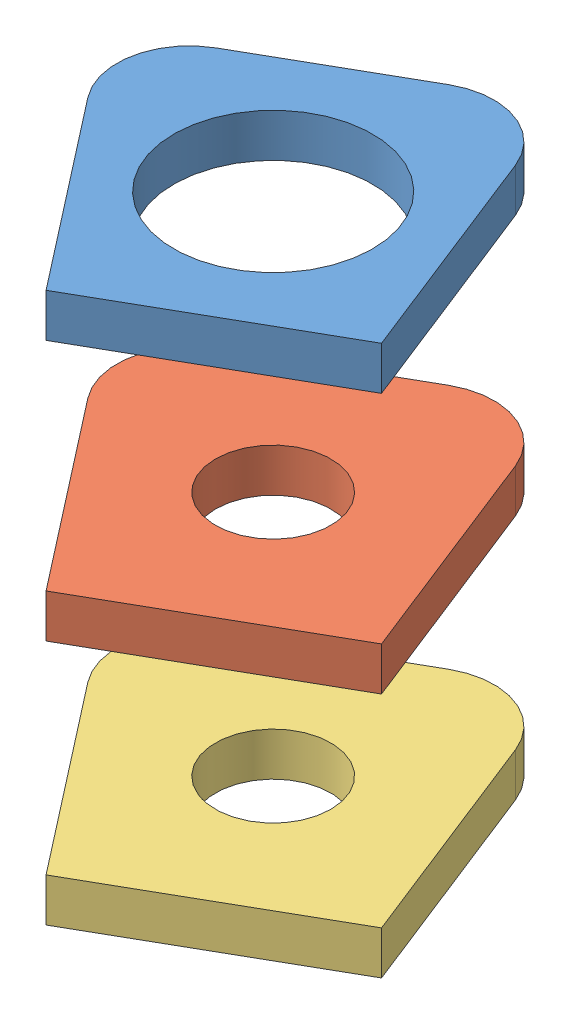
SolidWorks assembly Spindle_Assy.SLDASM, configuration Default (file format 6000). Lengths in mm.
Overall size (66.79 81 66.79).
20 component instances, 13 part files, 31 mates.
Components (placement in the parent):
- spindle_housing-1: spindle_housing.SLDPRT [Default] at origin (suppressed, hidden)
- spindle-top_plate-1: spindle-top_plate.SLDPRT [Default] at (-47.6912 75 -6.5455) x (0.964551 0 0.263896) z (-0.263896 0 0.964551) size (54.37 6 54.37)
- spindle-mid_plate-1: spindle-mid_plate.SLDPRT [Default] at (-47.6912 3 -6.5455) x (0.964551 0 0.263896) z (-0.263896 0 0.964551) size (54.37 6 54.37)
- spindle-bottom_plate-1: spindle-bottom_plate.SLDPRT [Default] at (-47.6912 -65 -6.5455) x (0.964551 0 0.263896) z (-0.263896 0 0.964551) size (54.37 6 54.37)
- spindle motor-1: spindle motor.SLDPRT [Default] at (0 101.5 0) x (0.33068 0 0.943743) z (0.943743 0 -0.33068) (suppressed, hidden)
- motor coupler-1: motor coupler.SLDPRT [large bore] at (0 60.1469 0) x (-0.335317 0 -0.942105) z (-0.942105 0 0.335317) (suppressed, hidden)
- motor coupler-2: motor coupler.SLDPRT [large bore] at (0 39.7675 0) x (0.335317 0 0.942105) z (-0.942105 0 0.335317) (suppressed, hidden)
- spindle sleeve-1: spindle sleeve.SLDPRT [Default] at (0 53.4 0) x (0.702313 0 0.711868) z (-0.711868 0 0.702313) (suppressed, hidden)
- spider-1: spider.SLDPRT [Default] at (0 48.3281 0) x (0.761446 0 0.648229) z (-0.648229 0 0.761446) (suppressed, hidden)
- spindle_bearing-1: spindle_bearing.SLDPRT [57155K337] at (0 1.2383 0) x (1 0 0) z (0 1 0) (suppressed, hidden)
- spindle_bearing-2: spindle_bearing.SLDPRT [57155K337] at (0 36.8618 0) x (1 0 0) z (0 -1 0) (suppressed, hidden)
- spindle_toolholder-1: spindle_toolholder.SLDPRT [Default] at (0 -1.5405 0) x (-0.751303 0 -0.659957) z (-0.659957 0 0.751303) (suppressed, hidden)
- spindle_shim-1: spindle_shim.SLDPRT [Default] at (0 39.6405 0) (suppressed, hidden)
- spindle_shaft-1: spindle_shaft.SLDPRT [Default] at (0 45.4495 0) x (-1 0 0) z (0 0 1) (suppressed, hidden)
- M3x12 BHCS-1: M3x12 BHCS.SLDPRT [92095A183] at (17.8141 72 8.2591) x (-0.823919 0.316742 0.469928) z (-0.495438 0 -0.868643) (suppressed, hidden)
- M3x12 BHCS-2: M3x12 BHCS.SLDPRT [92095A183] at (-1.9601 72 19.5375) x (-0.868643 0 0.495438) z (-0.495438 0 -0.868643) (suppressed, hidden)
- M3x12 BHCS-3: M3x12 BHCS.SLDPRT [92095A183] at (-1.9601 2 19.5375) x (-0.868643 0 0.495438) z (-0.495438 0 -0.868643) (suppressed, hidden)
- M3x12 BHCS-4: M3x12 BHCS.SLDPRT [92095A183] at (17.8141 2 8.2591) x (-0.868643 0 0.495438) z (-0.495438 0 -0.868643) (suppressed, hidden)
- M3x12 BHCS-5: M3x12 BHCS.SLDPRT [92095A183] at (17.8141 36 8.2591) x (-0.868643 0 0.495438) z (-0.495438 0 -0.868643) (suppressed, hidden)
- M3x12 BHCS-6: M3x12 BHCS.SLDPRT [92095A183] at (-1.9601 36 19.5375) x (-0.868643 0 0.495438) z (-0.495438 0 -0.868643) (suppressed, hidden)
Mates (geometry in assembly coordinates):
- Concentric1: concentric anti-aligned: cylinder of spindle_housing-1 through (0 38.1 0) axis (0 -1 0) radius 6.35; cylinder of spindle_bearing-1 through (0 3.6195 0) axis (0 1 0) radius 6.35
- Concentric2: concentric aligned: cylinder of spindle_bearing-2 through (0 34.4805 0) axis (0 -1 0) radius 6.35; cylinder of spindle_housing-1 through (0 38.1 0) axis (0 -1 0) radius 6.35
- Coincident1: coincident anti-aligned: plane of spindle_housing-1 through (0 38.1 0) normal (0 1 0); plane of spindle_bearing-2 through (0 38.1 5.1114) normal (0 -1 0)
- Coincident2: coincident anti-aligned: plane of spindle_housing-1 through (0 0 0) normal (0 -1 0); plane of spindle_bearing-1 through (0 0 -5.1114) normal (0 1 0)
- Concentric3: concentric aligned: cylinder of spindle motor-1 through (0 69 0) axis (0 1 0) radius 13.75; cylinder of spindle-top_plate-1 through (0 69 0) axis (0 1 0) radius 13.75
- Concentric4: concentric anti-aligned: cylinder of spindle_housing-1 through (0 38.1 0) axis (0 -1 0) radius 7.9375; cylinder of spindle-mid_plate-1 through (0 33 0) axis (0 1 0) radius 7.97
- Concentric5: concentric aligned: cylinder of spindle_housing-1 through (0 38.1 0) axis (0 -1 0) radius 7.9375; cylinder of spindle-bottom_plate-1 through (0 5 0) axis (0 -1 0) radius 7.97
- Concentric6: concentric anti-aligned: cylinder of spindle_housing-1 through (0 38.1 0) axis (0 -1 0) radius 7.9375; cylinder of spindle motor-1 through (0 69 0) axis (0 1 0) radius 13.75
- Distance4: distance = 1 mm aligned: plane of spindle_housing-1 through (0 0 0) normal (0 -1 0); plane of spindle-bottom_plate-1 through (4.2952 -1 -16.2381) normal (0 -1 0)
- Concentric7: concentric aligned: cylinder of spindle motor-1 through (0 104.4 0) axis (0 -1 0) radius 1.15; cylinder of spindle sleeve-1 through (0 65.4 0) axis (0 -1 0) radius 1.1303
- Coincident12: coincident aligned: plane of spindle motor-1 through (0 53.4 0) normal (0 -1 0); plane of spindle sleeve-1 through (0 53.4 0) normal (0 -1 0)
- Concentric8: concentric anti-aligned: cylinder of motor coupler-1 through (0 49.8281 0) axis (0 1 0) radius 3.175; cylinder of spindle sleeve-1 through (0 65.4 0) axis (0 -1 0) radius 3.175
- Coincident13: coincident aligned: plane of spindle-top_plate-1 through (-47.6912 69 -6.5455) normal (0 -1 0); plane of spindle motor-1 through (0 69 0) normal (0 -1 0)
- Concentric9: concentric aligned: cylinder of spindle_toolholder-1 through (0 -1.5405 0) axis (0 1 0) radius 3.175; cylinder of spindle_shaft-1 through (0 -8.5255 0) axis (0 1 0) radius 3.175
- Coincident14: coincident anti-aligned: plane of spindle_toolholder-1 through (2.3854 -8.5255 2.0954) normal (0 1 0); plane of spindle_shaft-1 through (0 -8.5255 0) normal (0 -1 0)
- Concentric10: concentric aligned: cylinder of spindle_shaft-1 through (0 -8.5255 0) axis (0 1 0) radius 3.175; cylinder of spindle_bearing-1 through (0 3.6195 0) axis (0 1 0) radius 3.175
- Coincident15: coincident anti-aligned: plane of spindle_bearing-1 through (0 -1.5405 -4.1755) normal (0 -1 0); plane of spindle_toolholder-1 through (4.7708 -1.5405 4.1907) normal (0 1 0)
- Concentric11: concentric aligned: circle of spindle_shim-1; cylinder of spindle_shaft-1 through (0 -8.5255 0) axis (0 1 0) radius 3.175
- Coincident16: coincident anti-aligned: plane of spindle_bearing-2 through (0 39.6405 4.1755) normal (0 1 0); plane of spindle_shim-1 through (0 39.6405 0) normal (0 -1 0)
- Coincident17: coincident aligned: plane of motor coupler-1 through (0 53.4 0) normal (0 -1 0); plane of spindle sleeve-1 through (0 53.4 0) normal (0 -1 0)
- Distance5: distance = 1.5 mm anti-aligned: plane of motor coupler-1 through (0 53.4 0) normal (0 -1 0); plane of spider-1 through (0 51.9 0) normal (0 1 0)
- Coincident19: coincident anti-aligned: plane of motor coupler-1 through (-1.6465 31.706 1.9341) normal (-0.335317 0 -0.942105); plane of spider-1 through (-1.6465 51.9 1.9341) normal (0.335317 0 0.942105)
- Concentric12: concentric anti-aligned: cylinder of motor coupler-1 through (0 53.4 0) axis (0 1 0) radius 7.9375; cylinder of spider-1 through (0 51.9 0) axis (0 -1 0) radius 7.9375
- Concentric13: concentric anti-aligned: cylinder of motor coupler-2 through (0 46.5144 0) axis (0 -1 0) radius 7.9375; cylinder of spindle_shaft-1 through (0 -8.5255 0) axis (0 1 0) radius 3.175
- Coincident21: coincident anti-aligned: plane of motor coupler-2 through (1.6465 68.2084 -1.9341) normal (-0.983546 0 -0.18066); plane of spider-1 through (1.6465 51.9 -1.9341) normal (0.983546 0 0.18066)
- Coincident22: coincident anti-aligned: plane of motor coupler-2 through (0 39.7675 0) normal (0 -1 0); plane of spindle_shim-1 through (0 39.7675 0) normal (0 1 0)
- Lock3: lock: unknown of spindle-bottom_plate-1
- Lock5: lock: unknown of spindle-mid_plate-1
- Concentric14: concentric aligned: cylinder of spindle-top_plate-1 through (0 69 0) axis (0 1 0) radius 13.75; cylinder of spindle-mid_plate-1 through (0 33 0) axis (0 1 0) radius 7.97
- Coincident28: coincident aligned: plane of spindle-top_plate-1 through (-22.2685 69 38.0278) normal (0.495438 0 0.868643); plane of spindle-mid_plate-1 through (-3.8673 33 27.5326) normal (0.495438 0 0.868643)
- Lock6: lock: unknown of spindle-top_plate-1
